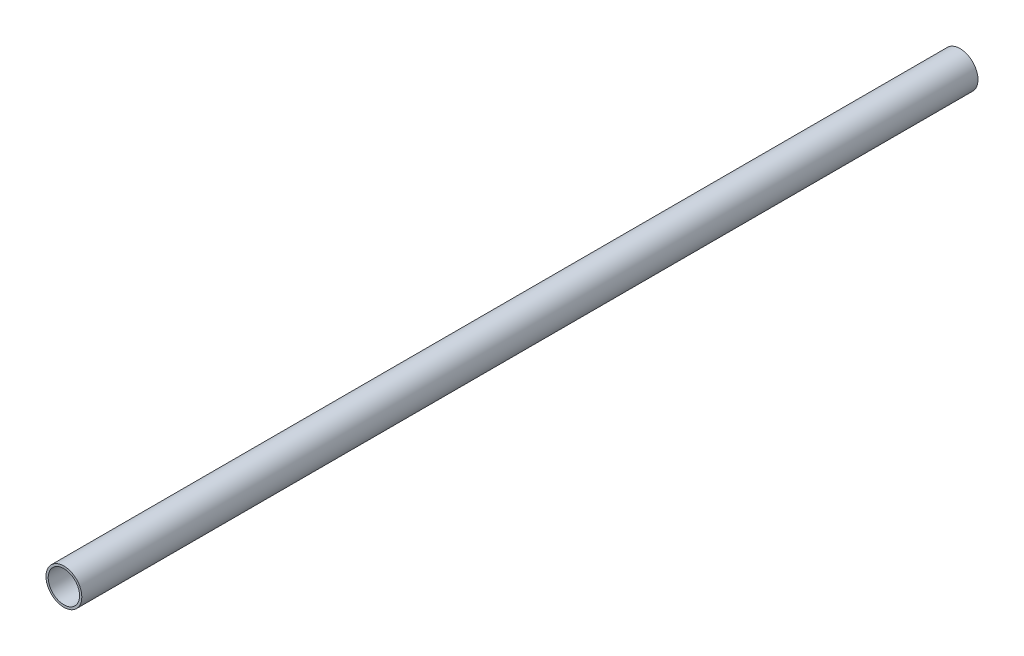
ISO-10303-21;
HEADER;
FILE_DESCRIPTION(('STEP AP214'),'2;1');
FILE_NAME('part.step','',(''),(''),'','','');
FILE_SCHEMA(('AUTOMOTIVE_DESIGN { 1 0 10303 214 1 1 1 1 }'));
ENDSEC;
DATA;
#1=APPLICATION_CONTEXT('core data for automotive mechanical design processes');
#2=APPLICATION_PROTOCOL_DEFINITION('international standard','automotive_design',2000,#1);
#3=PRODUCT_CONTEXT('',#1,'mechanical');
#4=PRODUCT('Part','Part','',(#3));
#5=PRODUCT_RELATED_PRODUCT_CATEGORY('part','',(#4));
#6=PRODUCT_DEFINITION_FORMATION('','',#4);
#7=PRODUCT_DEFINITION_CONTEXT('part definition',#1,'design');
#8=PRODUCT_DEFINITION('design','',#6,#7);
#9=PRODUCT_DEFINITION_SHAPE('','',#8);
#10=(LENGTH_UNIT() NAMED_UNIT(*) SI_UNIT(.MILLI.,.METRE.));
#11=(NAMED_UNIT(*) PLANE_ANGLE_UNIT() SI_UNIT($,.RADIAN.));
#12=(NAMED_UNIT(*) SI_UNIT($,.STERADIAN.) SOLID_ANGLE_UNIT());
#13=UNCERTAINTY_MEASURE_WITH_UNIT(LENGTH_MEASURE(1.E-05),#10,'distance_accuracy_value','');
#14=(GEOMETRIC_REPRESENTATION_CONTEXT(3) GLOBAL_UNCERTAINTY_ASSIGNED_CONTEXT((#13)) GLOBAL_UNIT_ASSIGNED_CONTEXT((#10,
#11,#12)) REPRESENTATION_CONTEXT('',''));
#15=CARTESIAN_POINT('',(0.,0.,0.));
#16=DIRECTION('',(0.,0.,1.));
#17=DIRECTION('',(1.,0.,0.));
#18=AXIS2_PLACEMENT_3D('',#15,#16,#17);
#19=CARTESIAN_POINT('',(0.,0.,400.));
#20=DIRECTION('',(0.,0.,1.));
#21=DIRECTION('',(1.,0.,0.));
#22=AXIS2_PLACEMENT_3D('',#19,#20,#21);
#23=PLANE('',#22);
#24=CARTESIAN_POINT('',(0.,0.,400.));
#25=DIRECTION('',(0.,0.,1.));
#26=DIRECTION('',(1.,0.,0.));
#27=AXIS2_PLACEMENT_3D('',#24,#25,#26);
#28=CIRCLE('',#27,8.);
#29=CARTESIAN_POINT('',(8.,0.,400.));
#30=VERTEX_POINT('',#29);
#31=EDGE_CURVE('E10',#30,#30,#28,.T.);
#32=ORIENTED_EDGE('',*,*,#31,.T.);
#33=EDGE_LOOP('',(#32));
#34=FACE_BOUND('',#33,.T.);
#35=CARTESIAN_POINT('',(0.,0.,400.));
#36=DIRECTION('',(0.,0.,1.));
#37=DIRECTION('',(1.,0.,0.));
#38=AXIS2_PLACEMENT_3D('',#35,#36,#37);
#39=CIRCLE('',#38,7.);
#40=CARTESIAN_POINT('',(7.,0.,400.));
#41=VERTEX_POINT('',#40);
#42=EDGE_CURVE('E50',#41,#41,#39,.T.);
#43=ORIENTED_EDGE('',*,*,#42,.F.);
#44=EDGE_LOOP('',(#43));
#45=FACE_BOUND('',#44,.T.);
#46=ADVANCED_FACE('F37',(#34,#45),#23,.T.);
#47=CARTESIAN_POINT('',(0.,0.,0.));
#48=DIRECTION('',(0.,0.,1.));
#49=DIRECTION('',(1.,0.,0.));
#50=AXIS2_PLACEMENT_3D('',#47,#48,#49);
#51=PLANE('',#50);
#52=CARTESIAN_POINT('',(0.,0.,0.));
#53=DIRECTION('',(0.,0.,1.));
#54=DIRECTION('',(1.,0.,0.));
#55=AXIS2_PLACEMENT_3D('',#52,#53,#54);
#56=CIRCLE('',#55,8.);
#57=CARTESIAN_POINT('',(8.,0.,0.));
#58=VERTEX_POINT('',#57);
#59=EDGE_CURVE('E41',#58,#58,#56,.T.);
#60=ORIENTED_EDGE('',*,*,#59,.F.);
#61=EDGE_LOOP('',(#60));
#62=FACE_BOUND('',#61,.T.);
#63=CARTESIAN_POINT('',(0.,0.,0.));
#64=DIRECTION('',(0.,0.,1.));
#65=DIRECTION('',(1.,0.,0.));
#66=AXIS2_PLACEMENT_3D('',#63,#64,#65);
#67=CIRCLE('',#66,7.);
#68=CARTESIAN_POINT('',(7.,0.,0.));
#69=VERTEX_POINT('',#68);
#70=EDGE_CURVE('E52',#69,#69,#67,.T.);
#71=ORIENTED_EDGE('',*,*,#70,.T.);
#72=EDGE_LOOP('',(#71));
#73=FACE_BOUND('',#72,.T.);
#74=ADVANCED_FACE('F64',(#62,#73),#51,.F.);
#75=CARTESIAN_POINT('',(0.,0.,400.));
#76=DIRECTION('',(0.,0.,-1.));
#77=DIRECTION('',(-1.,0.,0.));
#78=AXIS2_PLACEMENT_3D('',#75,#76,#77);
#79=CYLINDRICAL_SURFACE('',#78,8.);
#80=ORIENTED_EDGE('',*,*,#31,.F.);
#81=EDGE_LOOP('',(#80));
#82=FACE_BOUND('',#81,.T.);
#83=ORIENTED_EDGE('',*,*,#59,.T.);
#84=EDGE_LOOP('',(#83));
#85=FACE_BOUND('',#84,.T.);
#86=ADVANCED_FACE('F39',(#82,#85),#79,.T.);
#87=CARTESIAN_POINT('',(0.,0.,400.));
#88=DIRECTION('',(0.,0.,-1.));
#89=DIRECTION('',(-1.,0.,0.));
#90=AXIS2_PLACEMENT_3D('',#87,#88,#89);
#91=CYLINDRICAL_SURFACE('',#90,7.);
#92=ORIENTED_EDGE('',*,*,#42,.T.);
#93=EDGE_LOOP('',(#92));
#94=FACE_BOUND('',#93,.T.);
#95=ORIENTED_EDGE('',*,*,#70,.F.);
#96=EDGE_LOOP('',(#95));
#97=FACE_BOUND('',#96,.T.);
#98=ADVANCED_FACE('F60',(#94,#97),#91,.F.);
#99=CLOSED_SHELL('',(#46,#74,#86,#98));
#100=MANIFOLD_SOLID_BREP('B2',#99);
#101=ADVANCED_BREP_SHAPE_REPRESENTATION('',(#18,#100),#14);
#102=SHAPE_DEFINITION_REPRESENTATION(#9,#101);
ENDSEC;
END-ISO-10303-21;
